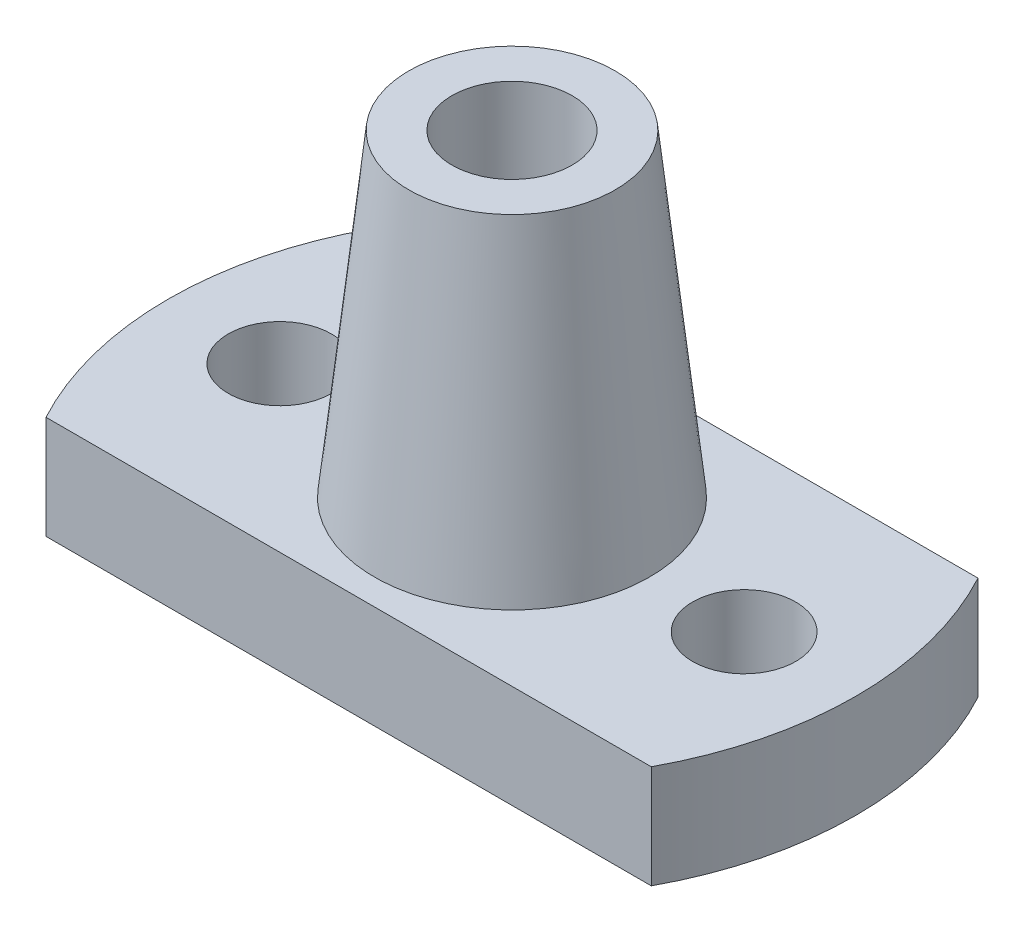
ISO-10303-21;
HEADER;
FILE_DESCRIPTION(('STEP AP214'),'2;1');
FILE_NAME('part.step','',(''),(''),'','','');
FILE_SCHEMA(('AUTOMOTIVE_DESIGN { 1 0 10303 214 1 1 1 1 }'));
ENDSEC;
DATA;
#1=APPLICATION_CONTEXT('core data for automotive mechanical design processes');
#2=APPLICATION_PROTOCOL_DEFINITION('international standard','automotive_design',2000,#1);
#3=PRODUCT_CONTEXT('',#1,'mechanical');
#4=PRODUCT('Part','Part','',(#3));
#5=PRODUCT_RELATED_PRODUCT_CATEGORY('part','',(#4));
#6=PRODUCT_DEFINITION_FORMATION('','',#4);
#7=PRODUCT_DEFINITION_CONTEXT('part definition',#1,'design');
#8=PRODUCT_DEFINITION('design','',#6,#7);
#9=PRODUCT_DEFINITION_SHAPE('','',#8);
#10=(LENGTH_UNIT() NAMED_UNIT(*) SI_UNIT(.MILLI.,.METRE.));
#11=(NAMED_UNIT(*) PLANE_ANGLE_UNIT() SI_UNIT($,.RADIAN.));
#12=(NAMED_UNIT(*) SI_UNIT($,.STERADIAN.) SOLID_ANGLE_UNIT());
#13=UNCERTAINTY_MEASURE_WITH_UNIT(LENGTH_MEASURE(1.E-05),#10,'distance_accuracy_value','');
#14=(GEOMETRIC_REPRESENTATION_CONTEXT(3) GLOBAL_UNCERTAINTY_ASSIGNED_CONTEXT((#13)) GLOBAL_UNIT_ASSIGNED_CONTEXT((#10,
#11,#12)) REPRESENTATION_CONTEXT('',''));
#15=CARTESIAN_POINT('',(0.,0.,0.));
#16=DIRECTION('',(0.,0.,1.));
#17=DIRECTION('',(1.,0.,0.));
#18=AXIS2_PLACEMENT_3D('',#15,#16,#17);
#19=CARTESIAN_POINT('',(0.,0.,0.));
#20=DIRECTION('',(0.,-1.,0.));
#21=DIRECTION('',(0.,0.,-1.));
#22=AXIS2_PLACEMENT_3D('',#19,#20,#21);
#23=CYLINDRICAL_SURFACE('',#22,40.);
#24=DIRECTION('',(0.,-1.,0.));
#25=VECTOR('',#24,1.);
#26=CARTESIAN_POINT('',(35.1994318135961,0.,19.));
#27=LINE('',#26,#25);
#28=CARTESIAN_POINT('',(35.1994318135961,0.,19.));
#29=VERTEX_POINT('',#28);
#30=CARTESIAN_POINT('',(35.1994318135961,12.,19.));
#31=VERTEX_POINT('',#30);
#32=EDGE_CURVE('E70',#29,#31,#27,.F.);
#33=ORIENTED_EDGE('',*,*,#32,.F.);
#34=CARTESIAN_POINT('',(0.,0.,0.));
#35=DIRECTION('',(0.,-1.,0.));
#36=DIRECTION('',(0.,0.,-1.));
#37=AXIS2_PLACEMENT_3D('',#34,#35,#36);
#38=CIRCLE('',#37,40.);
#39=CARTESIAN_POINT('',(35.1994318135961,0.,-19.));
#40=VERTEX_POINT('',#39);
#41=EDGE_CURVE('E104',#40,#29,#38,.T.);
#42=ORIENTED_EDGE('',*,*,#41,.F.);
#43=DIRECTION('',(0.,-1.,0.));
#44=VECTOR('',#43,1.);
#45=CARTESIAN_POINT('',(35.1994318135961,0.,-19.));
#46=LINE('',#45,#44);
#47=CARTESIAN_POINT('',(35.199431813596,12.,-19.));
#48=VERTEX_POINT('',#47);
#49=EDGE_CURVE('E53',#48,#40,#46,.T.);
#50=ORIENTED_EDGE('',*,*,#49,.F.);
#51=CARTESIAN_POINT('',(0.,12.,0.));
#52=DIRECTION('',(0.,-1.,0.));
#53=DIRECTION('',(0.,0.,-1.));
#54=AXIS2_PLACEMENT_3D('',#51,#52,#53);
#55=CIRCLE('',#54,40.);
#56=EDGE_CURVE('E86',#48,#31,#55,.T.);
#57=ORIENTED_EDGE('',*,*,#56,.T.);
#58=EDGE_LOOP('',(#33,#42,#50,#57));
#59=FACE_BOUND('',#58,.T.);
#60=ADVANCED_FACE('F31',(#59),#23,.T.);
#61=DIRECTION('',(0.,-1.,0.));
#62=VECTOR('',#61,1.);
#63=CARTESIAN_POINT('',(-35.1994318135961,0.,19.));
#64=LINE('',#63,#62);
#65=CARTESIAN_POINT('',(-35.1994318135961,12.,19.));
#66=VERTEX_POINT('',#65);
#67=CARTESIAN_POINT('',(-35.1994318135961,0.,19.));
#68=VERTEX_POINT('',#67);
#69=EDGE_CURVE('E45',#66,#68,#64,.T.);
#70=ORIENTED_EDGE('',*,*,#69,.F.);
#71=CARTESIAN_POINT('',(-35.1994318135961,12.,-19.));
#72=VERTEX_POINT('',#71);
#73=EDGE_CURVE('E87',#66,#72,#55,.T.);
#74=ORIENTED_EDGE('',*,*,#73,.T.);
#75=DIRECTION('',(0.,-1.,0.));
#76=VECTOR('',#75,1.);
#77=CARTESIAN_POINT('',(-35.1994318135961,0.,-19.));
#78=LINE('',#77,#76);
#79=CARTESIAN_POINT('',(-35.1994318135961,0.,-19.));
#80=VERTEX_POINT('',#79);
#81=EDGE_CURVE('E107',#80,#72,#78,.F.);
#82=ORIENTED_EDGE('',*,*,#81,.F.);
#83=EDGE_CURVE('E106',#68,#80,#38,.T.);
#84=ORIENTED_EDGE('',*,*,#83,.F.);
#85=EDGE_LOOP('',(#70,#74,#82,#84));
#86=FACE_BOUND('',#85,.T.);
#87=ADVANCED_FACE('F33',(#86),#23,.T.);
#88=CARTESIAN_POINT('',(40.,12.,0.));
#89=DIRECTION('',(0.,1.,0.));
#90=DIRECTION('',(0.,0.,1.));
#91=AXIS2_PLACEMENT_3D('',#88,#89,#90);
#92=PLANE('',#91);
#93=CARTESIAN_POINT('',(-27.,12.,0.));
#94=DIRECTION('',(0.,1.,0.));
#95=DIRECTION('',(0.,0.,-1.));
#96=AXIS2_PLACEMENT_3D('',#93,#94,#95);
#97=CIRCLE('',#96,6.);
#98=CARTESIAN_POINT('',(-27.,12.,-5.99999999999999));
#99=VERTEX_POINT('',#98);
#100=EDGE_CURVE('E119',#99,#99,#97,.T.);
#101=ORIENTED_EDGE('',*,*,#100,.F.);
#102=EDGE_LOOP('',(#101));
#103=FACE_BOUND('',#102,.T.);
#104=CARTESIAN_POINT('',(27.,12.,0.));
#105=DIRECTION('',(0.,1.,0.));
#106=DIRECTION('',(0.,0.,1.));
#107=AXIS2_PLACEMENT_3D('',#104,#105,#106);
#108=CIRCLE('',#107,6.);
#109=CARTESIAN_POINT('',(27.,12.,6.));
#110=VERTEX_POINT('',#109);
#111=EDGE_CURVE('E113',#110,#110,#108,.T.);
#112=ORIENTED_EDGE('',*,*,#111,.F.);
#113=EDGE_LOOP('',(#112));
#114=FACE_BOUND('',#113,.T.);
#115=DIRECTION('',(-1.,0.,0.));
#116=VECTOR('',#115,1.);
#117=CARTESIAN_POINT('',(-50.2441589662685,12.,19.));
#118=LINE('',#117,#116);
#119=EDGE_CURVE('E73',#31,#66,#118,.T.);
#120=ORIENTED_EDGE('',*,*,#119,.F.);
#121=ORIENTED_EDGE('',*,*,#56,.F.);
#122=DIRECTION('',(1.,0.,0.));
#123=VECTOR('',#122,1.);
#124=CARTESIAN_POINT('',(-50.2441589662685,12.,-19.));
#125=LINE('',#124,#123);
#126=EDGE_CURVE('E78',#72,#48,#125,.T.);
#127=ORIENTED_EDGE('',*,*,#126,.F.);
#128=ORIENTED_EDGE('',*,*,#73,.F.);
#129=EDGE_LOOP('',(#120,#121,#127,#128));
#130=FACE_BOUND('',#129,.T.);
#131=CARTESIAN_POINT('',(0.,12.,0.));
#132=DIRECTION('',(0.,-1.,0.));
#133=DIRECTION('',(0.,0.,-1.));
#134=AXIS2_PLACEMENT_3D('',#131,#132,#133);
#135=CIRCLE('',#134,16.);
#136=CARTESIAN_POINT('',(0.,12.,-16.));
#137=VERTEX_POINT('',#136);
#138=EDGE_CURVE('E91',#137,#137,#135,.T.);
#139=ORIENTED_EDGE('',*,*,#138,.T.);
#140=EDGE_LOOP('',(#139));
#141=FACE_BOUND('',#140,.T.);
#142=ADVANCED_FACE('F83',(#103,#114,#130,#141),#92,.T.);
#143=CARTESIAN_POINT('',(0.,12.,0.));
#144=DIRECTION('',(0.,-1.,0.));
#145=DIRECTION('',(0.,0.,-1.));
#146=AXIS2_PLACEMENT_3D('',#143,#144,#145);
#147=CONICAL_SURFACE('',#146,16.,0.107689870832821);
#148=CARTESIAN_POINT('',(0.,49.,0.));
#149=DIRECTION('',(0.,-1.,0.));
#150=DIRECTION('',(0.,0.,-1.));
#151=AXIS2_PLACEMENT_3D('',#148,#149,#150);
#152=CIRCLE('',#151,12.);
#153=CARTESIAN_POINT('',(0.,49.,-12.));
#154=VERTEX_POINT('',#153);
#155=EDGE_CURVE('E95',#154,#154,#152,.T.);
#156=ORIENTED_EDGE('',*,*,#155,.T.);
#157=EDGE_LOOP('',(#156));
#158=FACE_BOUND('',#157,.T.);
#159=ORIENTED_EDGE('',*,*,#138,.F.);
#160=EDGE_LOOP('',(#159));
#161=FACE_BOUND('',#160,.T.);
#162=ADVANCED_FACE('F137',(#158,#161),#147,.T.);
#163=CARTESIAN_POINT('',(12.,49.,0.));
#164=DIRECTION('',(0.,1.,0.));
#165=DIRECTION('',(0.,0.,1.));
#166=AXIS2_PLACEMENT_3D('',#163,#164,#165);
#167=PLANE('',#166);
#168=CARTESIAN_POINT('',(0.,49.,0.));
#169=DIRECTION('',(0.,-1.,0.));
#170=DIRECTION('',(0.,0.,-1.));
#171=AXIS2_PLACEMENT_3D('',#168,#169,#170);
#172=CIRCLE('',#171,6.99999999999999);
#173=CARTESIAN_POINT('',(0.,49.,-6.99999999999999));
#174=VERTEX_POINT('',#173);
#175=EDGE_CURVE('E98',#174,#174,#172,.T.);
#176=ORIENTED_EDGE('',*,*,#175,.T.);
#177=EDGE_LOOP('',(#176));
#178=FACE_BOUND('',#177,.T.);
#179=ORIENTED_EDGE('',*,*,#155,.F.);
#180=EDGE_LOOP('',(#179));
#181=FACE_BOUND('',#180,.T.);
#182=ADVANCED_FACE('F170',(#178,#181),#167,.T.);
#183=CARTESIAN_POINT('',(0.,0.,0.));
#184=DIRECTION('',(0.,-1.,0.));
#185=DIRECTION('',(0.,0.,-1.));
#186=AXIS2_PLACEMENT_3D('',#183,#184,#185);
#187=CYLINDRICAL_SURFACE('',#186,7.);
#188=CARTESIAN_POINT('',(0.,0.,0.));
#189=DIRECTION('',(0.,-1.,0.));
#190=DIRECTION('',(0.,0.,-1.));
#191=AXIS2_PLACEMENT_3D('',#188,#189,#190);
#192=CIRCLE('',#191,7.);
#193=CARTESIAN_POINT('',(0.,0.,-7.));
#194=VERTEX_POINT('',#193);
#195=EDGE_CURVE('E101',#194,#194,#192,.T.);
#196=ORIENTED_EDGE('',*,*,#195,.T.);
#197=EDGE_LOOP('',(#196));
#198=FACE_BOUND('',#197,.T.);
#199=ORIENTED_EDGE('',*,*,#175,.F.);
#200=EDGE_LOOP('',(#199));
#201=FACE_BOUND('',#200,.T.);
#202=ADVANCED_FACE('F165',(#198,#201),#187,.F.);
#203=CARTESIAN_POINT('',(7.,0.,0.));
#204=DIRECTION('',(0.,-1.,0.));
#205=DIRECTION('',(0.,0.,-1.));
#206=AXIS2_PLACEMENT_3D('',#203,#204,#205);
#207=PLANE('',#206);
#208=CARTESIAN_POINT('',(-27.,0.,0.));
#209=DIRECTION('',(0.,1.,0.));
#210=DIRECTION('',(0.,0.,-1.));
#211=AXIS2_PLACEMENT_3D('',#208,#209,#210);
#212=CIRCLE('',#211,6.);
#213=CARTESIAN_POINT('',(-27.,0.,-5.99999999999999));
#214=VERTEX_POINT('',#213);
#215=EDGE_CURVE('E116',#214,#214,#212,.T.);
#216=ORIENTED_EDGE('',*,*,#215,.T.);
#217=EDGE_LOOP('',(#216));
#218=FACE_BOUND('',#217,.T.);
#219=CARTESIAN_POINT('',(27.,0.,0.));
#220=DIRECTION('',(0.,1.,0.));
#221=DIRECTION('',(0.,0.,1.));
#222=AXIS2_PLACEMENT_3D('',#219,#220,#221);
#223=CIRCLE('',#222,6.);
#224=CARTESIAN_POINT('',(27.,0.,6.));
#225=VERTEX_POINT('',#224);
#226=EDGE_CURVE('E88',#225,#225,#223,.T.);
#227=ORIENTED_EDGE('',*,*,#226,.T.);
#228=EDGE_LOOP('',(#227));
#229=FACE_BOUND('',#228,.T.);
#230=DIRECTION('',(1.,0.,0.));
#231=VECTOR('',#230,1.);
#232=CARTESIAN_POINT('',(7.,0.,19.));
#233=LINE('',#232,#231);
#234=EDGE_CURVE('E11',#68,#29,#233,.T.);
#235=ORIENTED_EDGE('',*,*,#234,.F.);
#236=ORIENTED_EDGE('',*,*,#83,.T.);
#237=DIRECTION('',(-1.,0.,0.));
#238=VECTOR('',#237,1.);
#239=CARTESIAN_POINT('',(7.,0.,-19.));
#240=LINE('',#239,#238);
#241=EDGE_CURVE('E39',#40,#80,#240,.T.);
#242=ORIENTED_EDGE('',*,*,#241,.F.);
#243=ORIENTED_EDGE('',*,*,#41,.T.);
#244=EDGE_LOOP('',(#235,#236,#242,#243));
#245=FACE_BOUND('',#244,.T.);
#246=ORIENTED_EDGE('',*,*,#195,.F.);
#247=EDGE_LOOP('',(#246));
#248=FACE_BOUND('',#247,.T.);
#249=ADVANCED_FACE('F125',(#218,#229,#245,#248),#207,.T.);
#250=CARTESIAN_POINT('',(-50.2441589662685,0.,-19.));
#251=DIRECTION('',(0.,0.,1.));
#252=DIRECTION('',(1.,0.,0.));
#253=AXIS2_PLACEMENT_3D('',#250,#251,#252);
#254=PLANE('',#253);
#255=ORIENTED_EDGE('',*,*,#81,.T.);
#256=ORIENTED_EDGE('',*,*,#126,.T.);
#257=ORIENTED_EDGE('',*,*,#49,.T.);
#258=ORIENTED_EDGE('',*,*,#241,.T.);
#259=EDGE_LOOP('',(#255,#256,#257,#258));
#260=FACE_BOUND('',#259,.T.);
#261=ADVANCED_FACE('F146',(#260),#254,.F.);
#262=CARTESIAN_POINT('',(-50.2441589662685,0.,19.));
#263=DIRECTION('',(0.,0.,-1.));
#264=DIRECTION('',(-1.,0.,0.));
#265=AXIS2_PLACEMENT_3D('',#262,#263,#264);
#266=PLANE('',#265);
#267=ORIENTED_EDGE('',*,*,#32,.T.);
#268=ORIENTED_EDGE('',*,*,#119,.T.);
#269=ORIENTED_EDGE('',*,*,#69,.T.);
#270=ORIENTED_EDGE('',*,*,#234,.T.);
#271=EDGE_LOOP('',(#267,#268,#269,#270));
#272=FACE_BOUND('',#271,.T.);
#273=ADVANCED_FACE('F72',(#272),#266,.F.);
#274=CARTESIAN_POINT('',(27.,0.,0.));
#275=DIRECTION('',(0.,1.,0.));
#276=DIRECTION('',(0.,0.,1.));
#277=AXIS2_PLACEMENT_3D('',#274,#275,#276);
#278=CYLINDRICAL_SURFACE('',#277,6.);
#279=ORIENTED_EDGE('',*,*,#226,.F.);
#280=EDGE_LOOP('',(#279));
#281=FACE_BOUND('',#280,.T.);
#282=ORIENTED_EDGE('',*,*,#111,.T.);
#283=EDGE_LOOP('',(#282));
#284=FACE_BOUND('',#283,.T.);
#285=ADVANCED_FACE('F131',(#281,#284),#278,.F.);
#286=CARTESIAN_POINT('',(-27.,0.,0.));
#287=DIRECTION('',(0.,1.,0.));
#288=DIRECTION('',(0.,0.,1.));
#289=AXIS2_PLACEMENT_3D('',#286,#287,#288);
#290=CYLINDRICAL_SURFACE('',#289,6.);
#291=ORIENTED_EDGE('',*,*,#215,.F.);
#292=EDGE_LOOP('',(#291));
#293=FACE_BOUND('',#292,.T.);
#294=ORIENTED_EDGE('',*,*,#100,.T.);
#295=EDGE_LOOP('',(#294));
#296=FACE_BOUND('',#295,.T.);
#297=ADVANCED_FACE('F128',(#293,#296),#290,.F.);
#298=CLOSED_SHELL('',(#60,#87,#142,#162,#182,#202,#249,#261,#273,#285,#297));
#299=MANIFOLD_SOLID_BREP('B2',#298);
#300=ADVANCED_BREP_SHAPE_REPRESENTATION('',(#18,#299),#14);
#301=SHAPE_DEFINITION_REPRESENTATION(#9,#300);
ENDSEC;
END-ISO-10303-21;
